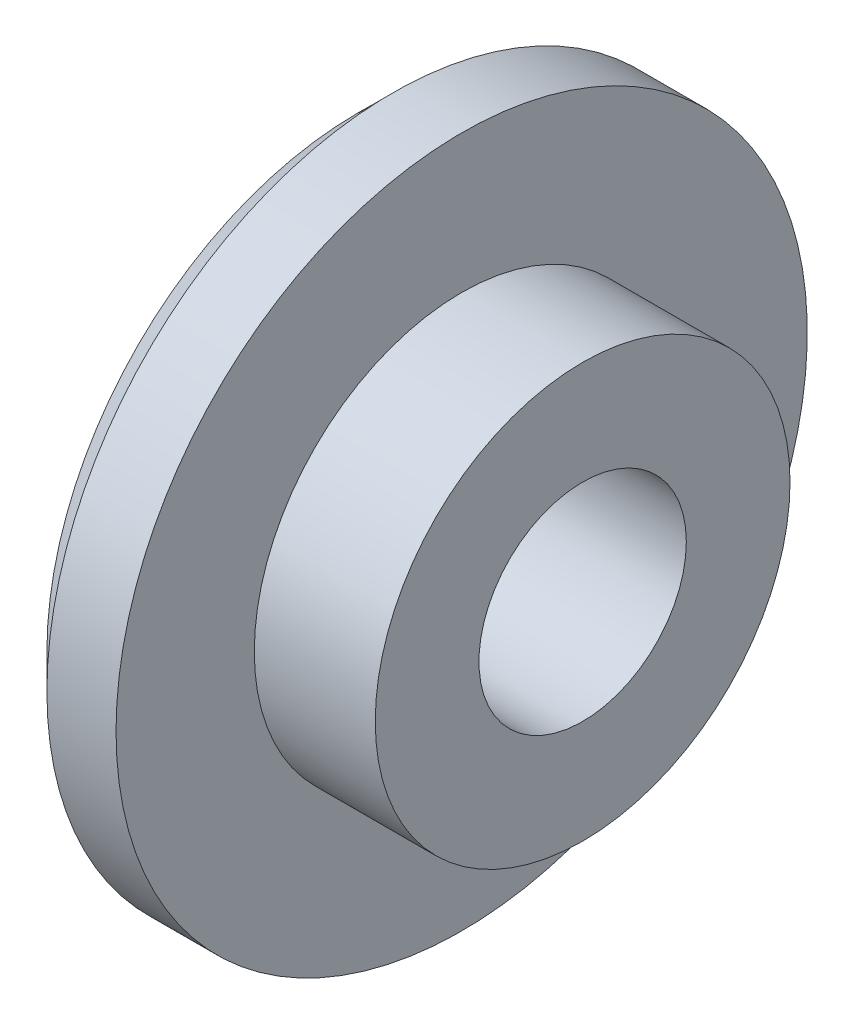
from build123d import *

# Parameters (mm, degrees)
SKETCH2_R          = 3
CUT_EXTRUDE1_DEPTH = 16.564382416
CHAMFER1_SIZE      = 1


with BuildPart() as part:
    # Sketch1 → Revolve1 (revolve)
    with BuildSketch(Plane(origin=(0, 0, 0), x_dir=(1, 0, 0), z_dir=(0, 1, 0)), mode=Mode.PRIVATE) as revolve1_sk:
        Polygon((0, 0), (6.5, 0), (6.5, 6), (3, 6), (3, 10), (0, 10), align=None)
    revolve(revolve1_sk.sketch.rotate(Axis((0, 0, 0), (1, 0, 0)), 180), axis=Axis((0, 0, 0), (1, 0, 0)))

    # Sketch2 → Cut-Extrude1 (cut, through all)
    with BuildSketch(Plane(origin=(6.5, 0, 0), x_dir=(0, 0, -1), z_dir=(1, 0, 0))):
        Circle(SKETCH2_R)
    extrude(amount=-CUT_EXTRUDE1_DEPTH, mode=Mode.SUBTRACT)

    # Chamfer1
    chamfer1_edges = [part.edges().sort_by_distance(p)[0] for p in [
        (0, 0, -10),
    ]]
    chamfer(chamfer1_edges, length=CHAMFER1_SIZE)


solid = part.part
